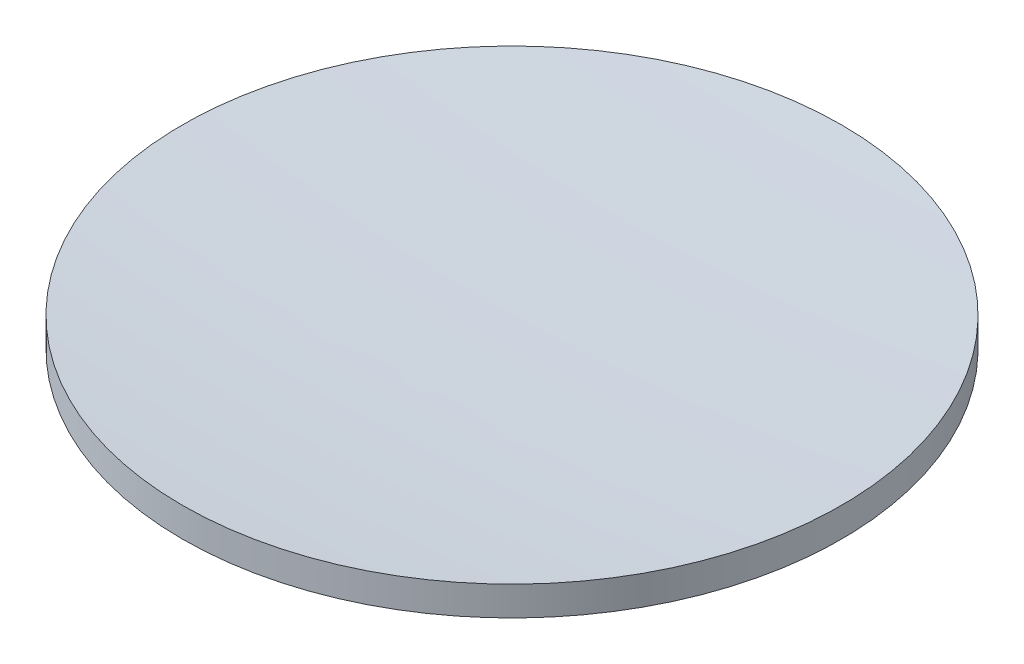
ISO-10303-21;
HEADER;
FILE_DESCRIPTION(('STEP AP214'),'2;1');
FILE_NAME('part.step','',(''),(''),'','','');
FILE_SCHEMA(('AUTOMOTIVE_DESIGN { 1 0 10303 214 1 1 1 1 }'));
ENDSEC;
DATA;
#1=APPLICATION_CONTEXT('core data for automotive mechanical design processes');
#2=APPLICATION_PROTOCOL_DEFINITION('international standard','automotive_design',2000,#1);
#3=PRODUCT_CONTEXT('',#1,'mechanical');
#4=PRODUCT('Part','Part','',(#3));
#5=PRODUCT_RELATED_PRODUCT_CATEGORY('part','',(#4));
#6=PRODUCT_DEFINITION_FORMATION('','',#4);
#7=PRODUCT_DEFINITION_CONTEXT('part definition',#1,'design');
#8=PRODUCT_DEFINITION('design','',#6,#7);
#9=PRODUCT_DEFINITION_SHAPE('','',#8);
#10=(LENGTH_UNIT() NAMED_UNIT(*) SI_UNIT(.MILLI.,.METRE.));
#11=(NAMED_UNIT(*) PLANE_ANGLE_UNIT() SI_UNIT($,.RADIAN.));
#12=(NAMED_UNIT(*) SI_UNIT($,.STERADIAN.) SOLID_ANGLE_UNIT());
#13=UNCERTAINTY_MEASURE_WITH_UNIT(LENGTH_MEASURE(1.E-05),#10,'distance_accuracy_value','');
#14=(GEOMETRIC_REPRESENTATION_CONTEXT(3) GLOBAL_UNCERTAINTY_ASSIGNED_CONTEXT((#13)) GLOBAL_UNIT_ASSIGNED_CONTEXT((#10,
#11,#12)) REPRESENTATION_CONTEXT('',''));
#15=CARTESIAN_POINT('',(0.,0.,0.));
#16=DIRECTION('',(0.,0.,1.));
#17=DIRECTION('',(1.,0.,0.));
#18=AXIS2_PLACEMENT_3D('',#15,#16,#17);
#19=CARTESIAN_POINT('',(0.,2.54,0.));
#20=DIRECTION('',(0.,-1.,0.));
#21=DIRECTION('',(0.,0.,-1.));
#22=AXIS2_PLACEMENT_3D('',#19,#20,#21);
#23=CYLINDRICAL_SURFACE('',#22,28.575);
#24=CARTESIAN_POINT('',(0.,2.53999999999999,0.));
#25=DIRECTION('',(0.,-1.,0.));
#26=DIRECTION('',(0.,0.,-1.));
#27=AXIS2_PLACEMENT_3D('',#24,#25,#26);
#28=CIRCLE('',#27,28.5750000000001);
#29=CARTESIAN_POINT('',(0.,2.53999999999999,-28.5750000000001));
#30=VERTEX_POINT('',#29);
#31=EDGE_CURVE('E34',#30,#30,#28,.T.);
#32=ORIENTED_EDGE('',*,*,#31,.T.);
#33=EDGE_LOOP('',(#32));
#34=FACE_BOUND('',#33,.T.);
#35=CARTESIAN_POINT('',(0.,0.,0.));
#36=DIRECTION('',(0.,1.,0.));
#37=DIRECTION('',(0.,0.,1.));
#38=AXIS2_PLACEMENT_3D('',#35,#36,#37);
#39=CIRCLE('',#38,28.575);
#40=CARTESIAN_POINT('',(0.,0.,28.575));
#41=VERTEX_POINT('',#40);
#42=EDGE_CURVE('E10',#41,#41,#39,.T.);
#43=ORIENTED_EDGE('',*,*,#42,.T.);
#44=EDGE_LOOP('',(#43));
#45=FACE_BOUND('',#44,.T.);
#46=ADVANCED_FACE('F28',(#34,#45),#23,.T.);
#47=CARTESIAN_POINT('',(0.,0.,0.));
#48=DIRECTION('',(0.,1.,0.));
#49=DIRECTION('',(0.,0.,1.));
#50=AXIS2_PLACEMENT_3D('',#47,#48,#49);
#51=PLANE('',#50);
#52=ORIENTED_EDGE('',*,*,#42,.F.);
#53=EDGE_LOOP('',(#52));
#54=FACE_BOUND('',#53,.T.);
#55=ADVANCED_FACE('F43',(#54),#51,.F.);
#56=CARTESIAN_POINT('',(0.,359.156000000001,0.));
#57=DIRECTION('',(0.,-1.,0.));
#58=DIRECTION('',(0.,0.,1.));
#59=AXIS2_PLACEMENT_3D('',#56,#57,#58);
#60=SPHERICAL_SURFACE('',#59,357.759000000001);
#61=ORIENTED_EDGE('',*,*,#31,.F.);
#62=EDGE_LOOP('',(#61));
#63=FACE_BOUND('',#62,.T.);
#64=ADVANCED_FACE('F41',(#63),#60,.F.);
#65=CLOSED_SHELL('',(#46,#55,#64));
#66=MANIFOLD_SOLID_BREP('B2',#65);
#67=ADVANCED_BREP_SHAPE_REPRESENTATION('',(#18,#66),#14);
#68=SHAPE_DEFINITION_REPRESENTATION(#9,#67);
ENDSEC;
END-ISO-10303-21;
